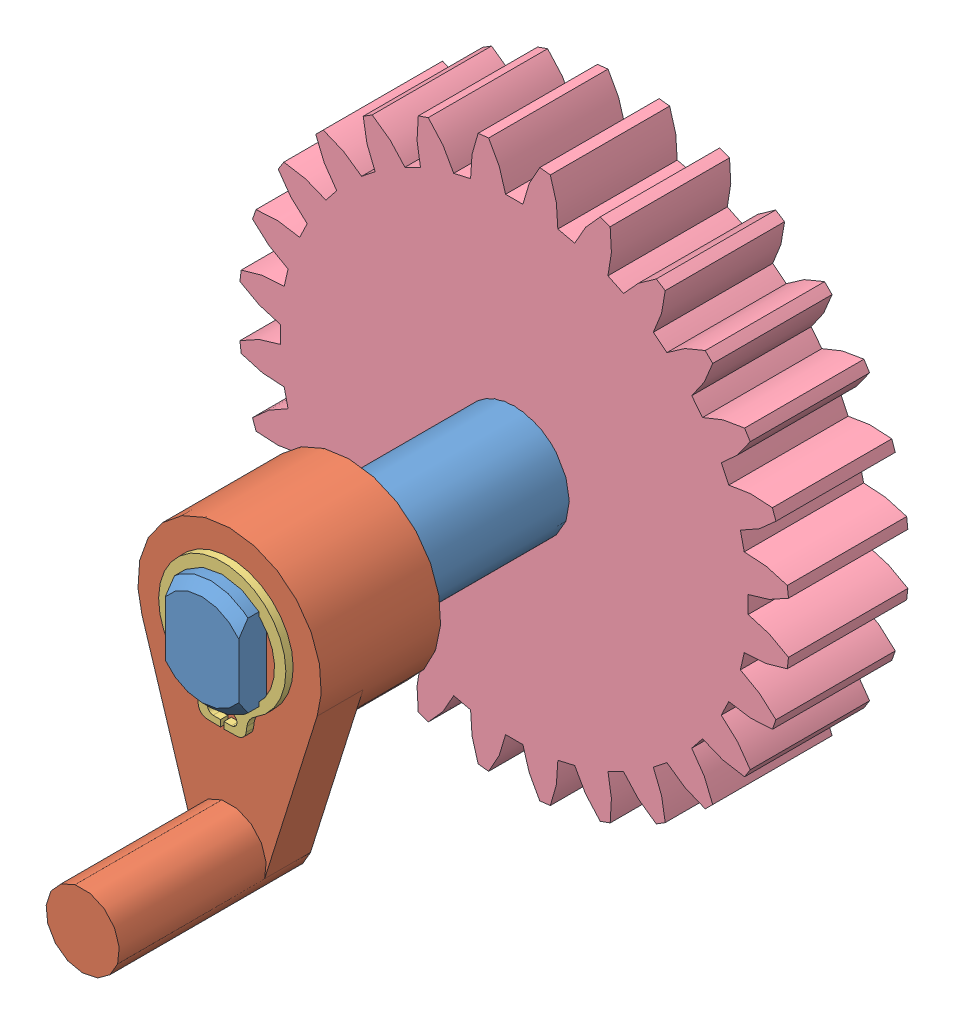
SolidWorks assembly excentrique.SLDASM, configuration Défaut (file format 3400). Lengths in mm.
Overall size (29.87 29.87 31.5).
5 component instances, 4 part files, 10 mates.
Components (placement in the parent):
- Axe excentrique-1: Axe excentrique.SLDPRT [Défaut] at origin size (6 6 25)
- excentrique-1: excentrique.SLDPRT [Défaut] at (0 0 4.5) x (0 -1 0) z (0 0 1) size (18.72 10 14.5)
- cirlips 6-1: cirlips 6.SLDPRT [B27.7M - 3AM1-6] at (0 0 11.4) size (6.93 7.85 0.4)
- roue 28 dents-1: roue 28 dents.SLDPRT [ISO - Spur gear 1M 28T 20PA 6.5FW ---S28A75H50L6.0N] at (0 0 -4.5) x (0 0 -1) z (0 -1 0) size (6.5 29.87 29.87)
- cirlips 6-2: cirlips 6.SLDPRT [B27.7M - 3AM1-6] at (0 0 -11) size (6.93 7.85 0.4)
Mates (geometry in assembly coordinates):
- Coaxiale1: concentric aligned: cylinder of Axe excentrique-1; cylinder of excentrique-1
- Coïncidente1: coincident anti-aligned: plane of Axe excentrique-1 through (2 3.3001 4.5) normal (1 0 0); plane of excentrique-1 through (2 2.2361 4.5) normal (-1 0 0)
- Coïncidente2: coincident anti-aligned: plane of Axe excentrique-1 through (0 0.0388 4.5) normal (0 0 1); plane of excentrique-1 through (0 0 4.5) normal (0 0 -1)
- Coaxiale2: concentric anti-aligned: unknown of Axe excentrique-1
- Coïncidente3: coincident anti-aligned: unknown of excentrique-1
- Coaxiale3: concentric anti-aligned: unknown of Axe excentrique-1
- Coïncidente4: coincident anti-aligned: unknown of Axe excentrique-1
- Coïncidente5: coincident anti-aligned: unknown of Axe excentrique-1
- Coaxiale4: concentric aligned: unknown of Axe excentrique-1
- Coïncidente6: coincident anti-aligned: plane of ?; plane of ?
